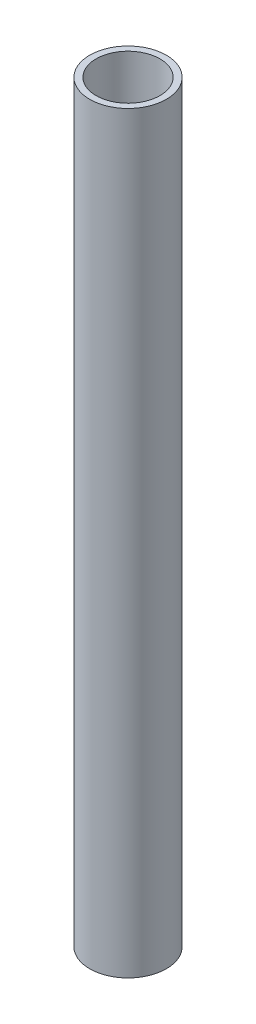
ISO-10303-21;
HEADER;
FILE_DESCRIPTION(('STEP AP214'),'2;1');
FILE_NAME('part.step','',(''),(''),'','','');
FILE_SCHEMA(('AUTOMOTIVE_DESIGN { 1 0 10303 214 1 1 1 1 }'));
ENDSEC;
DATA;
#1=APPLICATION_CONTEXT('core data for automotive mechanical design processes');
#2=APPLICATION_PROTOCOL_DEFINITION('international standard','automotive_design',2000,#1);
#3=PRODUCT_CONTEXT('',#1,'mechanical');
#4=PRODUCT('Part','Part','',(#3));
#5=PRODUCT_RELATED_PRODUCT_CATEGORY('part','',(#4));
#6=PRODUCT_DEFINITION_FORMATION('','',#4);
#7=PRODUCT_DEFINITION_CONTEXT('part definition',#1,'design');
#8=PRODUCT_DEFINITION('design','',#6,#7);
#9=PRODUCT_DEFINITION_SHAPE('','',#8);
#10=(LENGTH_UNIT() NAMED_UNIT(*) SI_UNIT(.MILLI.,.METRE.));
#11=(NAMED_UNIT(*) PLANE_ANGLE_UNIT() SI_UNIT($,.RADIAN.));
#12=(NAMED_UNIT(*) SI_UNIT($,.STERADIAN.) SOLID_ANGLE_UNIT());
#13=UNCERTAINTY_MEASURE_WITH_UNIT(LENGTH_MEASURE(1.E-05),#10,'distance_accuracy_value','');
#14=(GEOMETRIC_REPRESENTATION_CONTEXT(3) GLOBAL_UNCERTAINTY_ASSIGNED_CONTEXT((#13)) GLOBAL_UNIT_ASSIGNED_CONTEXT((#10,
#11,#12)) REPRESENTATION_CONTEXT('',''));
#15=CARTESIAN_POINT('',(0.,0.,0.));
#16=DIRECTION('',(0.,0.,1.));
#17=DIRECTION('',(1.,0.,0.));
#18=AXIS2_PLACEMENT_3D('',#15,#16,#17);
#19=CARTESIAN_POINT('',(0.,374.65,0.));
#20=DIRECTION('',(0.,1.,0.));
#21=DIRECTION('',(0.,0.,1.));
#22=AXIS2_PLACEMENT_3D('',#19,#20,#21);
#23=PLANE('',#22);
#24=CARTESIAN_POINT('',(0.,374.65,0.));
#25=DIRECTION('',(0.,1.,0.));
#26=DIRECTION('',(0.,0.,1.));
#27=AXIS2_PLACEMENT_3D('',#24,#25,#26);
#28=CIRCLE('',#27,19.05);
#29=CARTESIAN_POINT('',(0.,374.65,-19.05));
#30=VERTEX_POINT('',#29);
#31=EDGE_CURVE('E10',#30,#30,#28,.T.);
#32=ORIENTED_EDGE('',*,*,#31,.T.);
#33=EDGE_LOOP('',(#32));
#34=FACE_BOUND('',#33,.T.);
#35=CARTESIAN_POINT('',(0.,374.65,0.));
#36=DIRECTION('',(0.,1.,0.));
#37=DIRECTION('',(0.,0.,1.));
#38=AXIS2_PLACEMENT_3D('',#35,#36,#37);
#39=CIRCLE('',#38,15.875);
#40=CARTESIAN_POINT('',(0.,374.65,-15.875));
#41=VERTEX_POINT('',#40);
#42=EDGE_CURVE('E40',#41,#41,#39,.T.);
#43=ORIENTED_EDGE('',*,*,#42,.F.);
#44=EDGE_LOOP('',(#43));
#45=FACE_BOUND('',#44,.T.);
#46=ADVANCED_FACE('F29',(#34,#45),#23,.T.);
#47=CARTESIAN_POINT('',(0.,0.,0.));
#48=DIRECTION('',(0.,1.,0.));
#49=DIRECTION('',(0.,0.,1.));
#50=AXIS2_PLACEMENT_3D('',#47,#48,#49);
#51=PLANE('',#50);
#52=CARTESIAN_POINT('',(0.,0.,0.));
#53=DIRECTION('',(0.,1.,0.));
#54=DIRECTION('',(0.,0.,1.));
#55=AXIS2_PLACEMENT_3D('',#52,#53,#54);
#56=CIRCLE('',#55,19.05);
#57=CARTESIAN_POINT('',(0.,0.,-19.05));
#58=VERTEX_POINT('',#57);
#59=EDGE_CURVE('E33',#58,#58,#56,.T.);
#60=ORIENTED_EDGE('',*,*,#59,.F.);
#61=EDGE_LOOP('',(#60));
#62=FACE_BOUND('',#61,.T.);
#63=CARTESIAN_POINT('',(0.,0.,0.));
#64=DIRECTION('',(0.,1.,0.));
#65=DIRECTION('',(0.,0.,1.));
#66=AXIS2_PLACEMENT_3D('',#63,#64,#65);
#67=CIRCLE('',#66,15.875);
#68=CARTESIAN_POINT('',(0.,0.,-15.875));
#69=VERTEX_POINT('',#68);
#70=EDGE_CURVE('E42',#69,#69,#67,.T.);
#71=ORIENTED_EDGE('',*,*,#70,.T.);
#72=EDGE_LOOP('',(#71));
#73=FACE_BOUND('',#72,.T.);
#74=ADVANCED_FACE('F52',(#62,#73),#51,.F.);
#75=CARTESIAN_POINT('',(0.,374.65,0.));
#76=DIRECTION('',(0.,-1.,0.));
#77=DIRECTION('',(0.,0.,-1.));
#78=AXIS2_PLACEMENT_3D('',#75,#76,#77);
#79=CYLINDRICAL_SURFACE('',#78,19.05);
#80=CARTESIAN_POINT('',(0.,374.65,-19.05));
#81=CARTESIAN_POINT('',(0.,370.747395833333,-19.05));
#82=CARTESIAN_POINT('',(0.,366.844791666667,-19.05));
#83=CARTESIAN_POINT('',(0.,359.039583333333,-19.05));
#84=CARTESIAN_POINT('',(0.,355.136979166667,-19.05));
#85=CARTESIAN_POINT('',(0.,347.331770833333,-19.05));
#86=CARTESIAN_POINT('',(0.,343.429166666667,-19.05));
#87=CARTESIAN_POINT('',(0.,335.623958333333,-19.05));
#88=CARTESIAN_POINT('',(0.,331.721354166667,-19.05));
#89=CARTESIAN_POINT('',(0.,323.916145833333,-19.05));
#90=CARTESIAN_POINT('',(0.,320.013541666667,-19.05));
#91=CARTESIAN_POINT('',(0.,312.208333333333,-19.05));
#92=CARTESIAN_POINT('',(0.,308.305729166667,-19.05));
#93=CARTESIAN_POINT('',(0.,300.500520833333,-19.05));
#94=CARTESIAN_POINT('',(0.,296.597916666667,-19.05));
#95=CARTESIAN_POINT('',(0.,288.792708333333,-19.05));
#96=CARTESIAN_POINT('',(0.,284.890104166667,-19.05));
#97=CARTESIAN_POINT('',(0.,277.084895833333,-19.05));
#98=CARTESIAN_POINT('',(0.,273.182291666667,-19.05));
#99=CARTESIAN_POINT('',(0.,265.377083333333,-19.05));
#100=CARTESIAN_POINT('',(0.,261.474479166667,-19.05));
#101=CARTESIAN_POINT('',(0.,253.669270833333,-19.05));
#102=CARTESIAN_POINT('',(0.,249.766666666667,-19.05));
#103=CARTESIAN_POINT('',(0.,241.961458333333,-19.05));
#104=CARTESIAN_POINT('',(0.,238.058854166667,-19.05));
#105=CARTESIAN_POINT('',(0.,230.253645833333,-19.05));
#106=CARTESIAN_POINT('',(0.,226.351041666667,-19.05));
#107=CARTESIAN_POINT('',(0.,218.545833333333,-19.05));
#108=CARTESIAN_POINT('',(0.,214.643229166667,-19.05));
#109=CARTESIAN_POINT('',(0.,206.838020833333,-19.05));
#110=CARTESIAN_POINT('',(0.,202.935416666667,-19.05));
#111=CARTESIAN_POINT('',(0.,195.130208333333,-19.05));
#112=CARTESIAN_POINT('',(0.,191.227604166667,-19.05));
#113=CARTESIAN_POINT('',(0.,183.422395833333,-19.05));
#114=CARTESIAN_POINT('',(0.,179.519791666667,-19.05));
#115=CARTESIAN_POINT('',(0.,171.714583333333,-19.05));
#116=CARTESIAN_POINT('',(0.,167.811979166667,-19.05));
#117=CARTESIAN_POINT('',(0.,160.006770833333,-19.05));
#118=CARTESIAN_POINT('',(0.,156.104166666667,-19.05));
#119=CARTESIAN_POINT('',(0.,148.298958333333,-19.05));
#120=CARTESIAN_POINT('',(0.,144.396354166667,-19.05));
#121=CARTESIAN_POINT('',(0.,136.591145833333,-19.05));
#122=CARTESIAN_POINT('',(0.,132.688541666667,-19.05));
#123=CARTESIAN_POINT('',(0.,124.883333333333,-19.05));
#124=CARTESIAN_POINT('',(0.,120.980729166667,-19.05));
#125=CARTESIAN_POINT('',(0.,113.175520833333,-19.05));
#126=CARTESIAN_POINT('',(0.,109.272916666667,-19.05));
#127=CARTESIAN_POINT('',(0.,101.467708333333,-19.05));
#128=CARTESIAN_POINT('',(0.,97.5651041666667,-19.05));
#129=CARTESIAN_POINT('',(0.,89.7598958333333,-19.05));
#130=CARTESIAN_POINT('',(0.,85.8572916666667,-19.05));
#131=CARTESIAN_POINT('',(0.,78.0520833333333,-19.05));
#132=CARTESIAN_POINT('',(0.,74.1494791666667,-19.05));
#133=CARTESIAN_POINT('',(0.,66.3442708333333,-19.05));
#134=CARTESIAN_POINT('',(0.,62.4416666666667,-19.05));
#135=CARTESIAN_POINT('',(0.,54.6364583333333,-19.05));
#136=CARTESIAN_POINT('',(0.,50.7338541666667,-19.05));
#137=CARTESIAN_POINT('',(0.,42.9286458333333,-19.05));
#138=CARTESIAN_POINT('',(0.,39.0260416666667,-19.05));
#139=CARTESIAN_POINT('',(0.,31.2208333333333,-19.05));
#140=CARTESIAN_POINT('',(0.,27.3182291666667,-19.05));
#141=CARTESIAN_POINT('',(0.,19.5130208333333,-19.05));
#142=CARTESIAN_POINT('',(0.,15.6104166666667,-19.05));
#143=CARTESIAN_POINT('',(0.,7.80520833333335,-19.05));
#144=CARTESIAN_POINT('',(0.,3.90260416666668,-19.05));
#145=CARTESIAN_POINT('',(0.,0.,-19.05));
#146=B_SPLINE_CURVE_WITH_KNOTS('',3,(#80,#81,#82,#83,#84,#85,#86,#87,#88,#89,#90,#91,#92,#93,
#94,#95,#96,#97,#98,#99,#100,#101,#102,#103,#104,#105,#106,#107,#108,#109,#110,#111,#112,#113,
#114,#115,#116,#117,#118,#119,#120,#121,#122,#123,#124,#125,#126,#127,#128,#129,#130,#131,#132,
#133,#134,#135,#136,#137,#138,#139,#140,#141,#142,#143,#144,#145),.UNSPECIFIED.,.F.,.F.,(4,2,2,
2,2,2,2,2,2,2,2,2,2,2,2,2,2,2,2,2,2,2,2,2,2,2,2,2,2,2,2,2,4),(0.,11.7078125,23.4156249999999,
35.1234375,46.83125,58.5390625,70.2468749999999,81.9546875,93.6625,105.3703125,117.078125,
128.7859375,140.49375,152.2015625,163.909375,175.6171875,187.325,199.0328125,210.740625,
222.4484375,234.15625,245.8640625,257.571875,269.2796875,280.9875,292.6953125,304.403125,
316.1109375,327.81875,339.5265625,351.234375,362.9421875,374.65),.UNSPECIFIED.);
#147=EDGE_CURVE('BSEAM31',#30,#58,#146,.T.);
#148=ORIENTED_EDGE('',*,*,#31,.F.);
#149=ORIENTED_EDGE('',*,*,#59,.T.);
#150=ORIENTED_EDGE('',*,*,#147,.T.);
#151=ORIENTED_EDGE('',*,*,#147,.F.);
#152=EDGE_LOOP('',(#148,#150,#149,#151));
#153=FACE_BOUND('',#152,.T.);
#154=ADVANCED_FACE('F31',(#153),#79,.T.);
#155=CARTESIAN_POINT('',(0.,374.65,0.));
#156=DIRECTION('',(0.,-1.,0.));
#157=DIRECTION('',(0.,0.,-1.));
#158=AXIS2_PLACEMENT_3D('',#155,#156,#157);
#159=CYLINDRICAL_SURFACE('',#158,15.875);
#160=CARTESIAN_POINT('',(0.,374.65,-15.875));
#161=CARTESIAN_POINT('',(0.,370.747395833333,-15.875));
#162=CARTESIAN_POINT('',(0.,366.844791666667,-15.875));
#163=CARTESIAN_POINT('',(0.,359.039583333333,-15.875));
#164=CARTESIAN_POINT('',(0.,355.136979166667,-15.875));
#165=CARTESIAN_POINT('',(0.,347.331770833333,-15.875));
#166=CARTESIAN_POINT('',(0.,343.429166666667,-15.875));
#167=CARTESIAN_POINT('',(0.,335.623958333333,-15.875));
#168=CARTESIAN_POINT('',(0.,331.721354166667,-15.875));
#169=CARTESIAN_POINT('',(0.,323.916145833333,-15.875));
#170=CARTESIAN_POINT('',(0.,320.013541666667,-15.875));
#171=CARTESIAN_POINT('',(0.,312.208333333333,-15.875));
#172=CARTESIAN_POINT('',(0.,308.305729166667,-15.875));
#173=CARTESIAN_POINT('',(0.,300.500520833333,-15.875));
#174=CARTESIAN_POINT('',(0.,296.597916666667,-15.875));
#175=CARTESIAN_POINT('',(0.,288.792708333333,-15.875));
#176=CARTESIAN_POINT('',(0.,284.890104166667,-15.875));
#177=CARTESIAN_POINT('',(0.,277.084895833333,-15.875));
#178=CARTESIAN_POINT('',(0.,273.182291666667,-15.875));
#179=CARTESIAN_POINT('',(0.,265.377083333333,-15.875));
#180=CARTESIAN_POINT('',(0.,261.474479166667,-15.875));
#181=CARTESIAN_POINT('',(0.,253.669270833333,-15.875));
#182=CARTESIAN_POINT('',(0.,249.766666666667,-15.875));
#183=CARTESIAN_POINT('',(0.,241.961458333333,-15.875));
#184=CARTESIAN_POINT('',(0.,238.058854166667,-15.875));
#185=CARTESIAN_POINT('',(0.,230.253645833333,-15.875));
#186=CARTESIAN_POINT('',(0.,226.351041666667,-15.875));
#187=CARTESIAN_POINT('',(0.,218.545833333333,-15.875));
#188=CARTESIAN_POINT('',(0.,214.643229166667,-15.875));
#189=CARTESIAN_POINT('',(0.,206.838020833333,-15.875));
#190=CARTESIAN_POINT('',(0.,202.935416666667,-15.875));
#191=CARTESIAN_POINT('',(0.,195.130208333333,-15.875));
#192=CARTESIAN_POINT('',(0.,191.227604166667,-15.875));
#193=CARTESIAN_POINT('',(0.,183.422395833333,-15.875));
#194=CARTESIAN_POINT('',(0.,179.519791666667,-15.875));
#195=CARTESIAN_POINT('',(0.,171.714583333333,-15.875));
#196=CARTESIAN_POINT('',(0.,167.811979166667,-15.875));
#197=CARTESIAN_POINT('',(0.,160.006770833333,-15.875));
#198=CARTESIAN_POINT('',(0.,156.104166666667,-15.875));
#199=CARTESIAN_POINT('',(0.,148.298958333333,-15.875));
#200=CARTESIAN_POINT('',(0.,144.396354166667,-15.875));
#201=CARTESIAN_POINT('',(0.,136.591145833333,-15.875));
#202=CARTESIAN_POINT('',(0.,132.688541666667,-15.875));
#203=CARTESIAN_POINT('',(0.,124.883333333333,-15.875));
#204=CARTESIAN_POINT('',(0.,120.980729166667,-15.875));
#205=CARTESIAN_POINT('',(0.,113.175520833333,-15.875));
#206=CARTESIAN_POINT('',(0.,109.272916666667,-15.875));
#207=CARTESIAN_POINT('',(0.,101.467708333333,-15.875));
#208=CARTESIAN_POINT('',(0.,97.5651041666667,-15.875));
#209=CARTESIAN_POINT('',(0.,89.7598958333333,-15.875));
#210=CARTESIAN_POINT('',(0.,85.8572916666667,-15.875));
#211=CARTESIAN_POINT('',(0.,78.0520833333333,-15.875));
#212=CARTESIAN_POINT('',(0.,74.1494791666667,-15.875));
#213=CARTESIAN_POINT('',(0.,66.3442708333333,-15.875));
#214=CARTESIAN_POINT('',(0.,62.4416666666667,-15.875));
#215=CARTESIAN_POINT('',(0.,54.6364583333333,-15.875));
#216=CARTESIAN_POINT('',(0.,50.7338541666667,-15.875));
#217=CARTESIAN_POINT('',(0.,42.9286458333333,-15.875));
#218=CARTESIAN_POINT('',(0.,39.0260416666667,-15.875));
#219=CARTESIAN_POINT('',(0.,31.2208333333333,-15.875));
#220=CARTESIAN_POINT('',(0.,27.3182291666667,-15.875));
#221=CARTESIAN_POINT('',(0.,19.5130208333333,-15.875));
#222=CARTESIAN_POINT('',(0.,15.6104166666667,-15.875));
#223=CARTESIAN_POINT('',(0.,7.80520833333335,-15.875));
#224=CARTESIAN_POINT('',(0.,3.90260416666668,-15.875));
#225=CARTESIAN_POINT('',(0.,0.,-15.875));
#226=B_SPLINE_CURVE_WITH_KNOTS('',3,(#160,#161,#162,#163,#164,#165,#166,#167,#168,#169,#170,
#171,#172,#173,#174,#175,#176,#177,#178,#179,#180,#181,#182,#183,#184,#185,#186,#187,#188,#189,
#190,#191,#192,#193,#194,#195,#196,#197,#198,#199,#200,#201,#202,#203,#204,#205,#206,#207,#208,
#209,#210,#211,#212,#213,#214,#215,#216,#217,#218,#219,#220,#221,#222,#223,#224,#225),
.UNSPECIFIED.,.F.,.F.,(4,2,2,2,2,2,2,2,2,2,2,2,2,2,2,2,2,2,2,2,2,2,2,2,2,2,2,2,2,2,2,2,4),(0.,
11.7078125,23.4156249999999,35.1234375,46.83125,58.5390625,70.2468749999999,81.9546875,93.6625,
105.3703125,117.078125,128.7859375,140.49375,152.2015625,163.909375,175.6171875,187.325,
199.0328125,210.740625,222.4484375,234.15625,245.8640625,257.571875,269.2796875,280.9875,
292.6953125,304.403125,316.1109375,327.81875,339.5265625,351.234375,362.9421875,374.65),.UNSPECIFIED.);
#227=EDGE_CURVE('BSEAM48',#41,#69,#226,.T.);
#228=ORIENTED_EDGE('',*,*,#42,.T.);
#229=ORIENTED_EDGE('',*,*,#70,.F.);
#230=ORIENTED_EDGE('',*,*,#227,.T.);
#231=ORIENTED_EDGE('',*,*,#227,.F.);
#232=EDGE_LOOP('',(#228,#230,#229,#231));
#233=FACE_BOUND('',#232,.T.);
#234=ADVANCED_FACE('F48',(#233),#159,.F.);
#235=CLOSED_SHELL('',(#46,#74,#154,#234));
#236=MANIFOLD_SOLID_BREP('B2',#235);
#237=ADVANCED_BREP_SHAPE_REPRESENTATION('',(#18,#236),#14);
#238=SHAPE_DEFINITION_REPRESENTATION(#9,#237);
ENDSEC;
END-ISO-10303-21;
